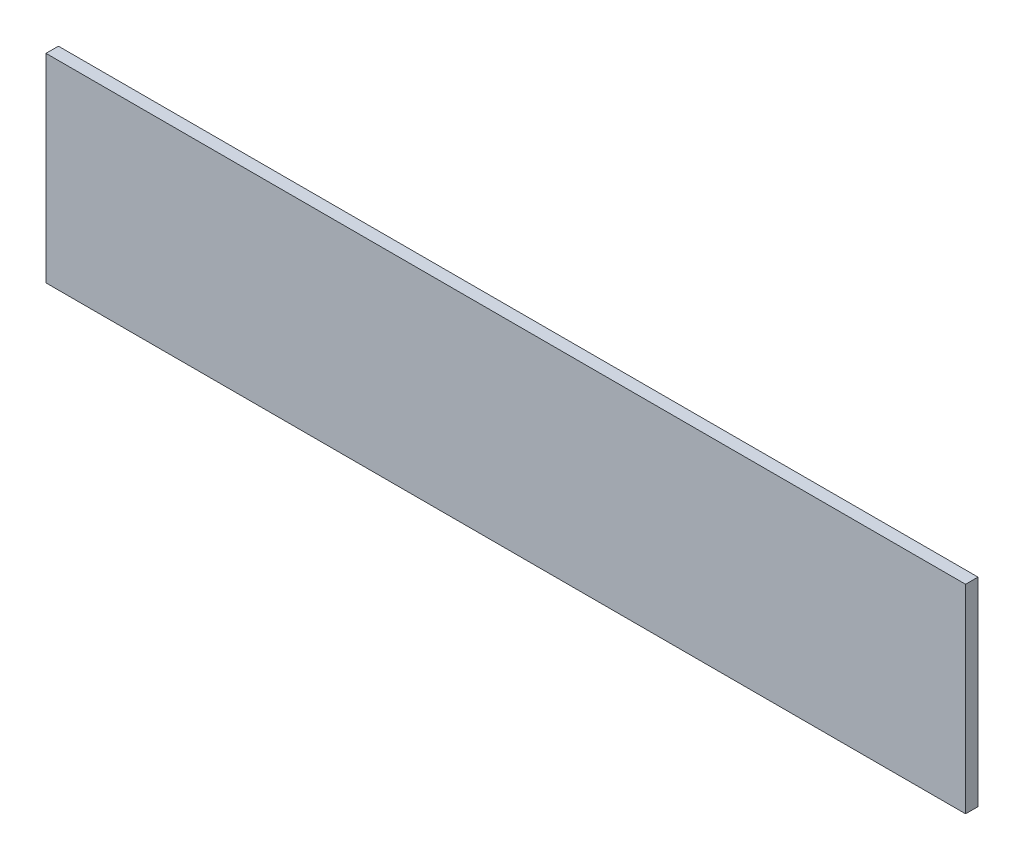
from build123d import *

# Parameters (mm, degrees)
SKETCH1_W           = 370
SKETCH1_H           = 80
BOSS_EXTRUDE1_DEPTH = 5


with BuildPart() as part:
    # Sketch1 → Boss-Extrude1 (new body)
    with BuildSketch(Plane.XY):
        with Locations((185, 40)):
            Rectangle(SKETCH1_W, SKETCH1_H)
    extrude(amount=BOSS_EXTRUDE1_DEPTH)


solid = part.part
